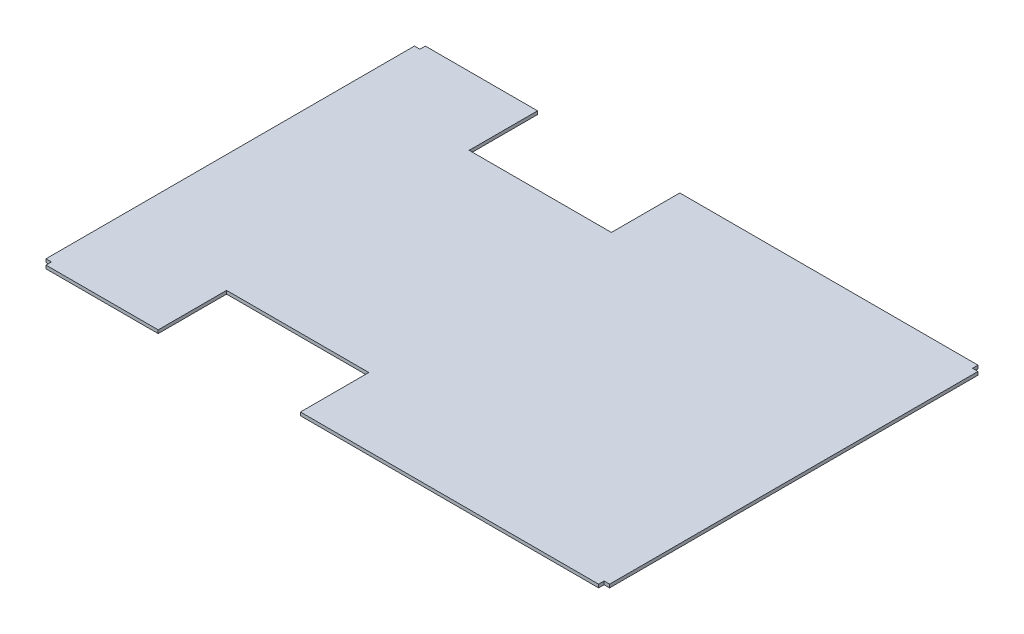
ISO-10303-21;
HEADER;
FILE_DESCRIPTION(('STEP AP214'),'2;1');
FILE_NAME('part.step','',(''),(''),'','','');
FILE_SCHEMA(('AUTOMOTIVE_DESIGN { 1 0 10303 214 1 1 1 1 }'));
ENDSEC;
DATA;
#1=APPLICATION_CONTEXT('core data for automotive mechanical design processes');
#2=APPLICATION_PROTOCOL_DEFINITION('international standard','automotive_design',2000,#1);
#3=PRODUCT_CONTEXT('',#1,'mechanical');
#4=PRODUCT('Part','Part','',(#3));
#5=PRODUCT_RELATED_PRODUCT_CATEGORY('part','',(#4));
#6=PRODUCT_DEFINITION_FORMATION('','',#4);
#7=PRODUCT_DEFINITION_CONTEXT('part definition',#1,'design');
#8=PRODUCT_DEFINITION('design','',#6,#7);
#9=PRODUCT_DEFINITION_SHAPE('','',#8);
#10=(LENGTH_UNIT() NAMED_UNIT(*) SI_UNIT(.MILLI.,.METRE.));
#11=(NAMED_UNIT(*) PLANE_ANGLE_UNIT() SI_UNIT($,.RADIAN.));
#12=(NAMED_UNIT(*) SI_UNIT($,.STERADIAN.) SOLID_ANGLE_UNIT());
#13=UNCERTAINTY_MEASURE_WITH_UNIT(LENGTH_MEASURE(1.E-05),#10,'distance_accuracy_value','');
#14=(GEOMETRIC_REPRESENTATION_CONTEXT(3) GLOBAL_UNCERTAINTY_ASSIGNED_CONTEXT((#13)) GLOBAL_UNIT_ASSIGNED_CONTEXT((#10,
#11,#12)) REPRESENTATION_CONTEXT('',''));
#15=CARTESIAN_POINT('',(0.,0.,0.));
#16=DIRECTION('',(0.,0.,1.));
#17=DIRECTION('',(1.,0.,0.));
#18=AXIS2_PLACEMENT_3D('',#15,#16,#17);
#19=CARTESIAN_POINT('',(0.,18.,0.));
#20=DIRECTION('',(0.,-1.,0.));
#21=DIRECTION('',(0.,0.,-1.));
#22=AXIS2_PLACEMENT_3D('',#19,#20,#21);
#23=PLANE('',#22);
#24=DIRECTION('',(0.,0.,-1.));
#25=VECTOR('',#24,1.);
#26=CARTESIAN_POINT('',(30.,18.,0.));
#27=LINE('',#26,#25);
#28=CARTESIAN_POINT('',(30.,18.,0.));
#29=VERTEX_POINT('',#28);
#30=CARTESIAN_POINT('',(30.,18.,-30.));
#31=VERTEX_POINT('',#30);
#32=EDGE_CURVE('E174',#29,#31,#27,.T.);
#33=ORIENTED_EDGE('',*,*,#32,.F.);
#34=DIRECTION('',(1.,0.,0.));
#35=VECTOR('',#34,1.);
#36=CARTESIAN_POINT('',(645.,18.,0.));
#37=LINE('',#36,#35);
#38=CARTESIAN_POINT('',(645.,18.,0.));
#39=VERTEX_POINT('',#38);
#40=EDGE_CURVE('E184',#29,#39,#37,.T.);
#41=ORIENTED_EDGE('',*,*,#40,.T.);
#42=DIRECTION('',(0.,0.,-1.));
#43=VECTOR('',#42,1.);
#44=CARTESIAN_POINT('',(645.,18.,-375.));
#45=LINE('',#44,#43);
#46=CARTESIAN_POINT('',(645.,18.,-375.));
#47=VERTEX_POINT('',#46);
#48=EDGE_CURVE('E191',#39,#47,#45,.T.);
#49=ORIENTED_EDGE('',*,*,#48,.T.);
#50=DIRECTION('',(1.,0.,0.));
#51=VECTOR('',#50,1.);
#52=CARTESIAN_POINT('',(1425.,18.,-375.000000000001));
#53=LINE('',#52,#51);
#54=CARTESIAN_POINT('',(1425.,18.,-375.000000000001));
#55=VERTEX_POINT('',#54);
#56=EDGE_CURVE('E194',#47,#55,#53,.T.);
#57=ORIENTED_EDGE('',*,*,#56,.T.);
#58=DIRECTION('',(0.,0.,1.));
#59=VECTOR('',#58,1.);
#60=CARTESIAN_POINT('',(1425.,18.,2.03903692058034E-13));
#61=LINE('',#60,#59);
#62=CARTESIAN_POINT('',(1425.,18.,2.03903692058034E-13));
#63=VERTEX_POINT('',#62);
#64=EDGE_CURVE('E204',#55,#63,#61,.T.);
#65=ORIENTED_EDGE('',*,*,#64,.T.);
#66=DIRECTION('',(1.,0.,0.));
#67=VECTOR('',#66,1.);
#68=CARTESIAN_POINT('',(3090.,18.,-3.63725254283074E-13));
#69=LINE('',#68,#67);
#70=CARTESIAN_POINT('',(3060.,18.,-3.53497705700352E-13));
#71=VERTEX_POINT('',#70);
#72=EDGE_CURVE('E206',#63,#71,#69,.T.);
#73=ORIENTED_EDGE('',*,*,#72,.T.);
#74=DIRECTION('',(0.,0.,1.));
#75=VECTOR('',#74,1.);
#76=CARTESIAN_POINT('',(3060.,18.,0.));
#77=LINE('',#76,#75);
#78=CARTESIAN_POINT('',(3060.,18.,-30.));
#79=VERTEX_POINT('',#78);
#80=EDGE_CURVE('E59',#79,#71,#77,.T.);
#81=ORIENTED_EDGE('',*,*,#80,.F.);
#82=DIRECTION('',(-1.,0.,0.));
#83=VECTOR('',#82,1.);
#84=CARTESIAN_POINT('',(3090.,18.,-30.));
#85=LINE('',#84,#83);
#86=CARTESIAN_POINT('',(3090.,18.,-30.));
#87=VERTEX_POINT('',#86);
#88=EDGE_CURVE('E500',#87,#79,#85,.T.);
#89=ORIENTED_EDGE('',*,*,#88,.F.);
#90=DIRECTION('',(0.,0.,-1.));
#91=VECTOR('',#90,1.);
#92=CARTESIAN_POINT('',(3090.,18.,-2080.));
#93=LINE('',#92,#91);
#94=CARTESIAN_POINT('',(3090.,18.,-2050.));
#95=VERTEX_POINT('',#94);
#96=EDGE_CURVE('E209',#87,#95,#93,.T.);
#97=ORIENTED_EDGE('',*,*,#96,.T.);
#98=DIRECTION('',(1.,0.,0.));
#99=VECTOR('',#98,1.);
#100=CARTESIAN_POINT('',(3090.,18.,-2050.));
#101=LINE('',#100,#99);
#102=CARTESIAN_POINT('',(3060.,18.,-2050.));
#103=VERTEX_POINT('',#102);
#104=EDGE_CURVE('E516',#103,#95,#101,.T.);
#105=ORIENTED_EDGE('',*,*,#104,.F.);
#106=DIRECTION('',(0.,0.,1.));
#107=VECTOR('',#106,1.);
#108=CARTESIAN_POINT('',(3060.,18.,-2080.));
#109=LINE('',#108,#107);
#110=CARTESIAN_POINT('',(3060.,18.,-2080.));
#111=VERTEX_POINT('',#110);
#112=EDGE_CURVE('E514',#111,#103,#109,.T.);
#113=ORIENTED_EDGE('',*,*,#112,.F.);
#114=DIRECTION('',(-1.,0.,0.));
#115=VECTOR('',#114,1.);
#116=CARTESIAN_POINT('',(1425.,18.,-2080.));
#117=LINE('',#116,#115);
#118=CARTESIAN_POINT('',(1425.,18.,-2080.));
#119=VERTEX_POINT('',#118);
#120=EDGE_CURVE('E211',#111,#119,#117,.T.);
#121=ORIENTED_EDGE('',*,*,#120,.T.);
#122=DIRECTION('',(0.,0.,1.));
#123=VECTOR('',#122,1.);
#124=CARTESIAN_POINT('',(1425.,18.,-1705.));
#125=LINE('',#124,#123);
#126=CARTESIAN_POINT('',(1425.,18.,-1705.));
#127=VERTEX_POINT('',#126);
#128=EDGE_CURVE('E213',#119,#127,#125,.T.);
#129=ORIENTED_EDGE('',*,*,#128,.T.);
#130=DIRECTION('',(-1.,0.,0.));
#131=VECTOR('',#130,1.);
#132=CARTESIAN_POINT('',(645.,18.,-1705.));
#133=LINE('',#132,#131);
#134=CARTESIAN_POINT('',(645.,18.,-1705.));
#135=VERTEX_POINT('',#134);
#136=EDGE_CURVE('E215',#127,#135,#133,.T.);
#137=ORIENTED_EDGE('',*,*,#136,.T.);
#138=DIRECTION('',(0.,0.,-1.));
#139=VECTOR('',#138,1.);
#140=CARTESIAN_POINT('',(645.,18.,-2080.));
#141=LINE('',#140,#139);
#142=CARTESIAN_POINT('',(645.,18.,-2080.));
#143=VERTEX_POINT('',#142);
#144=EDGE_CURVE('E217',#135,#143,#141,.T.);
#145=ORIENTED_EDGE('',*,*,#144,.T.);
#146=DIRECTION('',(-1.,0.,0.));
#147=VECTOR('',#146,1.);
#148=CARTESIAN_POINT('',(0.,18.,-2080.));
#149=LINE('',#148,#147);
#150=CARTESIAN_POINT('',(30.,18.,-2080.));
#151=VERTEX_POINT('',#150);
#152=EDGE_CURVE('E219',#143,#151,#149,.T.);
#153=ORIENTED_EDGE('',*,*,#152,.T.);
#154=DIRECTION('',(0.,0.,-1.));
#155=VECTOR('',#154,1.);
#156=CARTESIAN_POINT('',(30.,18.,-2080.));
#157=LINE('',#156,#155);
#158=CARTESIAN_POINT('',(30.,18.,-2050.));
#159=VERTEX_POINT('',#158);
#160=EDGE_CURVE('E535',#159,#151,#157,.T.);
#161=ORIENTED_EDGE('',*,*,#160,.F.);
#162=DIRECTION('',(1.,0.,0.));
#163=VECTOR('',#162,1.);
#164=CARTESIAN_POINT('',(0.,18.,-2050.));
#165=LINE('',#164,#163);
#166=CARTESIAN_POINT('',(0.,18.,-2050.));
#167=VERTEX_POINT('',#166);
#168=EDGE_CURVE('E533',#167,#159,#165,.T.);
#169=ORIENTED_EDGE('',*,*,#168,.F.);
#170=DIRECTION('',(0.,0.,1.));
#171=VECTOR('',#170,1.);
#172=CARTESIAN_POINT('',(0.,18.,0.));
#173=LINE('',#172,#171);
#174=CARTESIAN_POINT('',(0.,18.,-30.));
#175=VERTEX_POINT('',#174);
#176=EDGE_CURVE('E222',#167,#175,#173,.T.);
#177=ORIENTED_EDGE('',*,*,#176,.T.);
#178=DIRECTION('',(-1.,0.,0.));
#179=VECTOR('',#178,1.);
#180=CARTESIAN_POINT('',(0.,18.,-30.));
#181=LINE('',#180,#179);
#182=EDGE_CURVE('E187',#31,#175,#181,.T.);
#183=ORIENTED_EDGE('',*,*,#182,.F.);
#184=EDGE_LOOP('',(#33,#41,#49,#57,#65,#73,#81,#89,#97,#105,#113,#121,#129,#137,#145,#153,#161,
#169,#177,#183));
#185=FACE_BOUND('',#184,.T.);
#186=ADVANCED_FACE('F36',(#185),#23,.F.);
#187=CARTESIAN_POINT('',(0.,0.,0.));
#188=DIRECTION('',(0.,-1.,0.));
#189=DIRECTION('',(0.,0.,-1.));
#190=AXIS2_PLACEMENT_3D('',#187,#188,#189);
#191=PLANE('',#190);
#192=DIRECTION('',(1.,0.,0.));
#193=VECTOR('',#192,1.);
#194=CARTESIAN_POINT('',(645.,0.,0.));
#195=LINE('',#194,#193);
#196=CARTESIAN_POINT('',(29.9999999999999,0.,0.));
#197=VERTEX_POINT('',#196);
#198=CARTESIAN_POINT('',(645.,0.,0.));
#199=VERTEX_POINT('',#198);
#200=EDGE_CURVE('E225',#197,#199,#195,.T.);
#201=ORIENTED_EDGE('',*,*,#200,.F.);
#202=DIRECTION('',(0.,0.,-1.));
#203=VECTOR('',#202,1.);
#204=CARTESIAN_POINT('',(30.,0.,0.));
#205=LINE('',#204,#203);
#206=CARTESIAN_POINT('',(30.,0.,-30.));
#207=VERTEX_POINT('',#206);
#208=EDGE_CURVE('E51',#197,#207,#205,.T.);
#209=ORIENTED_EDGE('',*,*,#208,.T.);
#210=DIRECTION('',(-1.,0.,0.));
#211=VECTOR('',#210,1.);
#212=CARTESIAN_POINT('',(0.,0.,-30.));
#213=LINE('',#212,#211);
#214=CARTESIAN_POINT('',(0.,0.,-30.));
#215=VERTEX_POINT('',#214);
#216=EDGE_CURVE('E188',#207,#215,#213,.T.);
#217=ORIENTED_EDGE('',*,*,#216,.T.);
#218=DIRECTION('',(0.,0.,1.));
#219=VECTOR('',#218,1.);
#220=CARTESIAN_POINT('',(0.,0.,0.));
#221=LINE('',#220,#219);
#222=CARTESIAN_POINT('',(0.,0.,-2050.));
#223=VERTEX_POINT('',#222);
#224=EDGE_CURVE('E192',#223,#215,#221,.T.);
#225=ORIENTED_EDGE('',*,*,#224,.F.);
#226=DIRECTION('',(1.,0.,0.));
#227=VECTOR('',#226,1.);
#228=CARTESIAN_POINT('',(0.,0.,-2050.));
#229=LINE('',#228,#227);
#230=CARTESIAN_POINT('',(30.,0.,-2050.));
#231=VERTEX_POINT('',#230);
#232=EDGE_CURVE('E532',#223,#231,#229,.T.);
#233=ORIENTED_EDGE('',*,*,#232,.T.);
#234=DIRECTION('',(0.,0.,-1.));
#235=VECTOR('',#234,1.);
#236=CARTESIAN_POINT('',(30.,0.,-2080.));
#237=LINE('',#236,#235);
#238=CARTESIAN_POINT('',(30.,0.,-2080.));
#239=VERTEX_POINT('',#238);
#240=EDGE_CURVE('E536',#231,#239,#237,.T.);
#241=ORIENTED_EDGE('',*,*,#240,.T.);
#242=DIRECTION('',(-1.,0.,0.));
#243=VECTOR('',#242,1.);
#244=CARTESIAN_POINT('',(0.,0.,-2080.));
#245=LINE('',#244,#243);
#246=CARTESIAN_POINT('',(645.,0.,-2080.));
#247=VERTEX_POINT('',#246);
#248=EDGE_CURVE('E197',#247,#239,#245,.T.);
#249=ORIENTED_EDGE('',*,*,#248,.F.);
#250=DIRECTION('',(0.,0.,-1.));
#251=VECTOR('',#250,1.);
#252=CARTESIAN_POINT('',(645.,0.,-2080.));
#253=LINE('',#252,#251);
#254=CARTESIAN_POINT('',(645.,0.,-1705.));
#255=VERTEX_POINT('',#254);
#256=EDGE_CURVE('E244',#255,#247,#253,.T.);
#257=ORIENTED_EDGE('',*,*,#256,.F.);
#258=DIRECTION('',(-1.,0.,0.));
#259=VECTOR('',#258,1.);
#260=CARTESIAN_POINT('',(645.,0.,-1705.));
#261=LINE('',#260,#259);
#262=CARTESIAN_POINT('',(1425.,0.,-1705.));
#263=VERTEX_POINT('',#262);
#264=EDGE_CURVE('E242',#263,#255,#261,.T.);
#265=ORIENTED_EDGE('',*,*,#264,.F.);
#266=DIRECTION('',(0.,0.,1.));
#267=VECTOR('',#266,1.);
#268=CARTESIAN_POINT('',(1425.,0.,-1705.));
#269=LINE('',#268,#267);
#270=CARTESIAN_POINT('',(1425.,0.,-2080.));
#271=VERTEX_POINT('',#270);
#272=EDGE_CURVE('E240',#271,#263,#269,.T.);
#273=ORIENTED_EDGE('',*,*,#272,.F.);
#274=DIRECTION('',(-1.,0.,0.));
#275=VECTOR('',#274,1.);
#276=CARTESIAN_POINT('',(1425.,0.,-2080.));
#277=LINE('',#276,#275);
#278=CARTESIAN_POINT('',(3060.,0.,-2080.));
#279=VERTEX_POINT('',#278);
#280=EDGE_CURVE('E238',#279,#271,#277,.T.);
#281=ORIENTED_EDGE('',*,*,#280,.F.);
#282=DIRECTION('',(0.,0.,1.));
#283=VECTOR('',#282,1.);
#284=CARTESIAN_POINT('',(3060.,0.,-2080.));
#285=LINE('',#284,#283);
#286=CARTESIAN_POINT('',(3060.,0.,-2050.));
#287=VERTEX_POINT('',#286);
#288=EDGE_CURVE('E513',#279,#287,#285,.T.);
#289=ORIENTED_EDGE('',*,*,#288,.T.);
#290=DIRECTION('',(1.,0.,0.));
#291=VECTOR('',#290,1.);
#292=CARTESIAN_POINT('',(3090.,0.,-2050.));
#293=LINE('',#292,#291);
#294=CARTESIAN_POINT('',(3090.,0.,-2050.));
#295=VERTEX_POINT('',#294);
#296=EDGE_CURVE('E517',#287,#295,#293,.T.);
#297=ORIENTED_EDGE('',*,*,#296,.T.);
#298=DIRECTION('',(0.,0.,-1.));
#299=VECTOR('',#298,1.);
#300=CARTESIAN_POINT('',(3090.,0.,-2080.));
#301=LINE('',#300,#299);
#302=CARTESIAN_POINT('',(3090.,0.,-30.));
#303=VERTEX_POINT('',#302);
#304=EDGE_CURVE('E236',#303,#295,#301,.T.);
#305=ORIENTED_EDGE('',*,*,#304,.F.);
#306=DIRECTION('',(-1.,0.,0.));
#307=VECTOR('',#306,1.);
#308=CARTESIAN_POINT('',(3090.,0.,-30.));
#309=LINE('',#308,#307);
#310=CARTESIAN_POINT('',(3060.,0.,-30.));
#311=VERTEX_POINT('',#310);
#312=EDGE_CURVE('E179',#303,#311,#309,.T.);
#313=ORIENTED_EDGE('',*,*,#312,.T.);
#314=DIRECTION('',(0.,0.,1.));
#315=VECTOR('',#314,1.);
#316=CARTESIAN_POINT('',(3060.,0.,0.));
#317=LINE('',#316,#315);
#318=CARTESIAN_POINT('',(3060.,0.,0.));
#319=VERTEX_POINT('',#318);
#320=EDGE_CURVE('E502',#311,#319,#317,.T.);
#321=ORIENTED_EDGE('',*,*,#320,.T.);
#322=DIRECTION('',(1.,0.,0.));
#323=VECTOR('',#322,1.);
#324=CARTESIAN_POINT('',(3090.,0.,-3.63725254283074E-13));
#325=LINE('',#324,#323);
#326=CARTESIAN_POINT('',(1425.,0.,2.03903692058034E-13));
#327=VERTEX_POINT('',#326);
#328=EDGE_CURVE('E233',#327,#319,#325,.T.);
#329=ORIENTED_EDGE('',*,*,#328,.F.);
#330=DIRECTION('',(0.,0.,1.));
#331=VECTOR('',#330,1.);
#332=CARTESIAN_POINT('',(1425.,0.,2.03903692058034E-13));
#333=LINE('',#332,#331);
#334=CARTESIAN_POINT('',(1425.,0.,-375.000000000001));
#335=VERTEX_POINT('',#334);
#336=EDGE_CURVE('E231',#335,#327,#333,.T.);
#337=ORIENTED_EDGE('',*,*,#336,.F.);
#338=DIRECTION('',(1.,0.,0.));
#339=VECTOR('',#338,1.);
#340=CARTESIAN_POINT('',(1425.,0.,-375.000000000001));
#341=LINE('',#340,#339);
#342=CARTESIAN_POINT('',(645.,0.,-375.));
#343=VERTEX_POINT('',#342);
#344=EDGE_CURVE('E229',#343,#335,#341,.T.);
#345=ORIENTED_EDGE('',*,*,#344,.F.);
#346=DIRECTION('',(0.,0.,-1.));
#347=VECTOR('',#346,1.);
#348=CARTESIAN_POINT('',(645.,0.,-375.));
#349=LINE('',#348,#347);
#350=EDGE_CURVE('E227',#199,#343,#349,.T.);
#351=ORIENTED_EDGE('',*,*,#350,.F.);
#352=EDGE_LOOP('',(#201,#209,#217,#225,#233,#241,#249,#257,#265,#273,#281,#289,#297,#305,#313,
#321,#329,#337,#345,#351));
#353=FACE_BOUND('',#352,.T.);
#354=ADVANCED_FACE('F275',(#353),#191,.T.);
#355=CARTESIAN_POINT('',(0.,18.,0.));
#356=DIRECTION('',(1.,0.,0.));
#357=DIRECTION('',(0.,0.,-1.));
#358=AXIS2_PLACEMENT_3D('',#355,#356,#357);
#359=PLANE('',#358);
#360=DIRECTION('',(0.,-1.,0.));
#361=VECTOR('',#360,1.);
#362=CARTESIAN_POINT('',(0.,18.,-30.));
#363=LINE('',#362,#361);
#364=EDGE_CURVE('E492',#175,#215,#363,.T.);
#365=ORIENTED_EDGE('',*,*,#364,.F.);
#366=ORIENTED_EDGE('',*,*,#176,.F.);
#367=DIRECTION('',(0.,-1.,0.));
#368=VECTOR('',#367,1.);
#369=CARTESIAN_POINT('',(0.,18.,-2050.));
#370=LINE('',#369,#368);
#371=EDGE_CURVE('E200',#167,#223,#370,.T.);
#372=ORIENTED_EDGE('',*,*,#371,.T.);
#373=ORIENTED_EDGE('',*,*,#224,.T.);
#374=EDGE_LOOP('',(#365,#366,#372,#373));
#375=FACE_BOUND('',#374,.T.);
#376=ADVANCED_FACE('F303',(#375),#359,.F.);
#377=CARTESIAN_POINT('',(645.,18.,0.));
#378=DIRECTION('',(0.,0.,-1.));
#379=DIRECTION('',(-1.,0.,0.));
#380=AXIS2_PLACEMENT_3D('',#377,#378,#379);
#381=PLANE('',#380);
#382=DIRECTION('',(0.,-1.,0.));
#383=VECTOR('',#382,1.);
#384=CARTESIAN_POINT('',(30.,18.,0.));
#385=LINE('',#384,#383);
#386=EDGE_CURVE('E171',#29,#197,#385,.T.);
#387=ORIENTED_EDGE('',*,*,#386,.T.);
#388=ORIENTED_EDGE('',*,*,#200,.T.);
#389=DIRECTION('',(0.,-1.,0.));
#390=VECTOR('',#389,1.);
#391=CARTESIAN_POINT('',(645.,18.,0.));
#392=LINE('',#391,#390);
#393=EDGE_CURVE('E11',#39,#199,#392,.T.);
#394=ORIENTED_EDGE('',*,*,#393,.F.);
#395=ORIENTED_EDGE('',*,*,#40,.F.);
#396=EDGE_LOOP('',(#387,#388,#394,#395));
#397=FACE_BOUND('',#396,.T.);
#398=ADVANCED_FACE('F38',(#397),#381,.F.);
#399=CARTESIAN_POINT('',(3090.,18.,-2080.));
#400=DIRECTION('',(-1.,0.,0.));
#401=DIRECTION('',(0.,0.,1.));
#402=AXIS2_PLACEMENT_3D('',#399,#400,#401);
#403=PLANE('',#402);
#404=DIRECTION('',(0.,-1.,0.));
#405=VECTOR('',#404,1.);
#406=CARTESIAN_POINT('',(3090.,18.,-30.));
#407=LINE('',#406,#405);
#408=EDGE_CURVE('E510',#87,#303,#407,.T.);
#409=ORIENTED_EDGE('',*,*,#408,.T.);
#410=ORIENTED_EDGE('',*,*,#304,.T.);
#411=DIRECTION('',(0.,-1.,0.));
#412=VECTOR('',#411,1.);
#413=CARTESIAN_POINT('',(3090.,18.,-2050.));
#414=LINE('',#413,#412);
#415=EDGE_CURVE('E520',#95,#295,#414,.T.);
#416=ORIENTED_EDGE('',*,*,#415,.F.);
#417=ORIENTED_EDGE('',*,*,#96,.F.);
#418=EDGE_LOOP('',(#409,#410,#416,#417));
#419=FACE_BOUND('',#418,.T.);
#420=ADVANCED_FACE('F327',(#419),#403,.F.);
#421=CARTESIAN_POINT('',(3090.,18.,-3.63725254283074E-13));
#422=DIRECTION('',(0.,0.,-1.));
#423=DIRECTION('',(-1.,0.,0.));
#424=AXIS2_PLACEMENT_3D('',#421,#422,#423);
#425=PLANE('',#424);
#426=DIRECTION('',(0.,-1.,0.));
#427=VECTOR('',#426,1.);
#428=CARTESIAN_POINT('',(3060.,18.,0.));
#429=LINE('',#428,#427);
#430=EDGE_CURVE('E285',#71,#319,#429,.T.);
#431=ORIENTED_EDGE('',*,*,#430,.F.);
#432=ORIENTED_EDGE('',*,*,#72,.F.);
#433=DIRECTION('',(0.,-1.,0.));
#434=VECTOR('',#433,1.);
#435=CARTESIAN_POINT('',(1425.,18.,2.03903692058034E-13));
#436=LINE('',#435,#434);
#437=EDGE_CURVE('E259',#63,#327,#436,.T.);
#438=ORIENTED_EDGE('',*,*,#437,.T.);
#439=ORIENTED_EDGE('',*,*,#328,.T.);
#440=EDGE_LOOP('',(#431,#432,#438,#439));
#441=FACE_BOUND('',#440,.T.);
#442=ADVANCED_FACE('F284',(#441),#425,.F.);
#443=CARTESIAN_POINT('',(1425.,18.,-2080.));
#444=DIRECTION('',(0.,0.,1.));
#445=DIRECTION('',(1.,0.,0.));
#446=AXIS2_PLACEMENT_3D('',#443,#444,#445);
#447=PLANE('',#446);
#448=DIRECTION('',(0.,-1.,0.));
#449=VECTOR('',#448,1.);
#450=CARTESIAN_POINT('',(3060.,18.,-2080.));
#451=LINE('',#450,#449);
#452=EDGE_CURVE('E529',#111,#279,#451,.T.);
#453=ORIENTED_EDGE('',*,*,#452,.T.);
#454=ORIENTED_EDGE('',*,*,#280,.T.);
#455=DIRECTION('',(0.,-1.,0.));
#456=VECTOR('',#455,1.);
#457=CARTESIAN_POINT('',(1425.,18.,-2080.));
#458=LINE('',#457,#456);
#459=EDGE_CURVE('E256',#119,#271,#458,.T.);
#460=ORIENTED_EDGE('',*,*,#459,.F.);
#461=ORIENTED_EDGE('',*,*,#120,.F.);
#462=EDGE_LOOP('',(#453,#454,#460,#461));
#463=FACE_BOUND('',#462,.T.);
#464=ADVANCED_FACE('F295',(#463),#447,.F.);
#465=CARTESIAN_POINT('',(0.,18.,-2080.));
#466=DIRECTION('',(0.,0.,1.));
#467=DIRECTION('',(1.,0.,0.));
#468=AXIS2_PLACEMENT_3D('',#465,#466,#467);
#469=PLANE('',#468);
#470=DIRECTION('',(0.,-1.,0.));
#471=VECTOR('',#470,1.);
#472=CARTESIAN_POINT('',(30.,18.,-2080.));
#473=LINE('',#472,#471);
#474=EDGE_CURVE('E538',#151,#239,#473,.T.);
#475=ORIENTED_EDGE('',*,*,#474,.F.);
#476=ORIENTED_EDGE('',*,*,#152,.F.);
#477=DIRECTION('',(0.,-1.,0.));
#478=VECTOR('',#477,1.);
#479=CARTESIAN_POINT('',(645.,18.,-2080.));
#480=LINE('',#479,#478);
#481=EDGE_CURVE('E224',#143,#247,#480,.T.);
#482=ORIENTED_EDGE('',*,*,#481,.T.);
#483=ORIENTED_EDGE('',*,*,#248,.T.);
#484=EDGE_LOOP('',(#475,#476,#482,#483));
#485=FACE_BOUND('',#484,.T.);
#486=ADVANCED_FACE('F289',(#485),#469,.F.);
#487=CARTESIAN_POINT('',(645.,18.,-375.));
#488=DIRECTION('',(-1.,0.,0.));
#489=DIRECTION('',(0.,0.,1.));
#490=AXIS2_PLACEMENT_3D('',#487,#488,#489);
#491=PLANE('',#490);
#492=ORIENTED_EDGE('',*,*,#350,.T.);
#493=DIRECTION('',(0.,-1.,0.));
#494=VECTOR('',#493,1.);
#495=CARTESIAN_POINT('',(645.,18.,-375.));
#496=LINE('',#495,#494);
#497=EDGE_CURVE('E44',#47,#343,#496,.T.);
#498=ORIENTED_EDGE('',*,*,#497,.F.);
#499=ORIENTED_EDGE('',*,*,#48,.F.);
#500=ORIENTED_EDGE('',*,*,#393,.T.);
#501=EDGE_LOOP('',(#492,#498,#499,#500));
#502=FACE_BOUND('',#501,.T.);
#503=ADVANCED_FACE('F287',(#502),#491,.F.);
#504=CARTESIAN_POINT('',(1425.,18.,-375.000000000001));
#505=DIRECTION('',(0.,0.,-1.));
#506=DIRECTION('',(-1.,0.,0.));
#507=AXIS2_PLACEMENT_3D('',#504,#505,#506);
#508=PLANE('',#507);
#509=ORIENTED_EDGE('',*,*,#344,.T.);
#510=DIRECTION('',(0.,-1.,0.));
#511=VECTOR('',#510,1.);
#512=CARTESIAN_POINT('',(1425.,18.,-375.000000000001));
#513=LINE('',#512,#511);
#514=EDGE_CURVE('E262',#55,#335,#513,.T.);
#515=ORIENTED_EDGE('',*,*,#514,.F.);
#516=ORIENTED_EDGE('',*,*,#56,.F.);
#517=ORIENTED_EDGE('',*,*,#497,.T.);
#518=EDGE_LOOP('',(#509,#515,#516,#517));
#519=FACE_BOUND('',#518,.T.);
#520=ADVANCED_FACE('F269',(#519),#508,.F.);
#521=CARTESIAN_POINT('',(1425.,18.,2.03903692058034E-13));
#522=DIRECTION('',(1.,0.,0.));
#523=DIRECTION('',(0.,0.,-1.));
#524=AXIS2_PLACEMENT_3D('',#521,#522,#523);
#525=PLANE('',#524);
#526=ORIENTED_EDGE('',*,*,#336,.T.);
#527=ORIENTED_EDGE('',*,*,#437,.F.);
#528=ORIENTED_EDGE('',*,*,#64,.F.);
#529=ORIENTED_EDGE('',*,*,#514,.T.);
#530=EDGE_LOOP('',(#526,#527,#528,#529));
#531=FACE_BOUND('',#530,.T.);
#532=ADVANCED_FACE('F280',(#531),#525,.F.);
#533=CARTESIAN_POINT('',(1425.,18.,-1705.));
#534=DIRECTION('',(1.,0.,0.));
#535=DIRECTION('',(0.,0.,-1.));
#536=AXIS2_PLACEMENT_3D('',#533,#534,#535);
#537=PLANE('',#536);
#538=ORIENTED_EDGE('',*,*,#272,.T.);
#539=DIRECTION('',(0.,-1.,0.));
#540=VECTOR('',#539,1.);
#541=CARTESIAN_POINT('',(1425.,18.,-1705.));
#542=LINE('',#541,#540);
#543=EDGE_CURVE('E253',#127,#263,#542,.T.);
#544=ORIENTED_EDGE('',*,*,#543,.F.);
#545=ORIENTED_EDGE('',*,*,#128,.F.);
#546=ORIENTED_EDGE('',*,*,#459,.T.);
#547=EDGE_LOOP('',(#538,#544,#545,#546));
#548=FACE_BOUND('',#547,.T.);
#549=ADVANCED_FACE('F319',(#548),#537,.F.);
#550=CARTESIAN_POINT('',(645.,18.,-1705.));
#551=DIRECTION('',(0.,0.,1.));
#552=DIRECTION('',(1.,0.,0.));
#553=AXIS2_PLACEMENT_3D('',#550,#551,#552);
#554=PLANE('',#553);
#555=ORIENTED_EDGE('',*,*,#264,.T.);
#556=DIRECTION('',(0.,-1.,0.));
#557=VECTOR('',#556,1.);
#558=CARTESIAN_POINT('',(645.,18.,-1705.));
#559=LINE('',#558,#557);
#560=EDGE_CURVE('E250',#135,#255,#559,.T.);
#561=ORIENTED_EDGE('',*,*,#560,.F.);
#562=ORIENTED_EDGE('',*,*,#136,.F.);
#563=ORIENTED_EDGE('',*,*,#543,.T.);
#564=EDGE_LOOP('',(#555,#561,#562,#563));
#565=FACE_BOUND('',#564,.T.);
#566=ADVANCED_FACE('F315',(#565),#554,.F.);
#567=CARTESIAN_POINT('',(645.,18.,-2080.));
#568=DIRECTION('',(-1.,0.,0.));
#569=DIRECTION('',(0.,0.,1.));
#570=AXIS2_PLACEMENT_3D('',#567,#568,#569);
#571=PLANE('',#570);
#572=ORIENTED_EDGE('',*,*,#256,.T.);
#573=ORIENTED_EDGE('',*,*,#481,.F.);
#574=ORIENTED_EDGE('',*,*,#144,.F.);
#575=ORIENTED_EDGE('',*,*,#560,.T.);
#576=EDGE_LOOP('',(#572,#573,#574,#575));
#577=FACE_BOUND('',#576,.T.);
#578=ADVANCED_FACE('F312',(#577),#571,.F.);
#579=CARTESIAN_POINT('',(0.,18.,-2050.));
#580=DIRECTION('',(0.,0.,-1.));
#581=DIRECTION('',(-1.,0.,0.));
#582=AXIS2_PLACEMENT_3D('',#579,#580,#581);
#583=PLANE('',#582);
#584=ORIENTED_EDGE('',*,*,#232,.F.);
#585=ORIENTED_EDGE('',*,*,#371,.F.);
#586=ORIENTED_EDGE('',*,*,#168,.T.);
#587=DIRECTION('',(0.,-1.,0.));
#588=VECTOR('',#587,1.);
#589=CARTESIAN_POINT('',(30.,18.,-2050.));
#590=LINE('',#589,#588);
#591=EDGE_CURVE('E543',#159,#231,#590,.T.);
#592=ORIENTED_EDGE('',*,*,#591,.T.);
#593=EDGE_LOOP('',(#584,#585,#586,#592));
#594=FACE_BOUND('',#593,.T.);
#595=ADVANCED_FACE('F306',(#594),#583,.T.);
#596=CARTESIAN_POINT('',(30.,18.,-2080.));
#597=DIRECTION('',(-1.,0.,0.));
#598=DIRECTION('',(0.,0.,1.));
#599=AXIS2_PLACEMENT_3D('',#596,#597,#598);
#600=PLANE('',#599);
#601=ORIENTED_EDGE('',*,*,#240,.F.);
#602=ORIENTED_EDGE('',*,*,#591,.F.);
#603=ORIENTED_EDGE('',*,*,#160,.T.);
#604=ORIENTED_EDGE('',*,*,#474,.T.);
#605=EDGE_LOOP('',(#601,#602,#603,#604));
#606=FACE_BOUND('',#605,.T.);
#607=ADVANCED_FACE('F356',(#606),#600,.T.);
#608=CARTESIAN_POINT('',(3060.,18.,-2080.));
#609=DIRECTION('',(1.,0.,0.));
#610=DIRECTION('',(0.,0.,-1.));
#611=AXIS2_PLACEMENT_3D('',#608,#609,#610);
#612=PLANE('',#611);
#613=ORIENTED_EDGE('',*,*,#288,.F.);
#614=ORIENTED_EDGE('',*,*,#452,.F.);
#615=ORIENTED_EDGE('',*,*,#112,.T.);
#616=DIRECTION('',(0.,-1.,0.));
#617=VECTOR('',#616,1.);
#618=CARTESIAN_POINT('',(3060.,18.,-2050.));
#619=LINE('',#618,#617);
#620=EDGE_CURVE('E527',#103,#287,#619,.T.);
#621=ORIENTED_EDGE('',*,*,#620,.T.);
#622=EDGE_LOOP('',(#613,#614,#615,#621));
#623=FACE_BOUND('',#622,.T.);
#624=ADVANCED_FACE('F364',(#623),#612,.T.);
#625=CARTESIAN_POINT('',(3090.,18.,-2050.));
#626=DIRECTION('',(0.,0.,-1.));
#627=DIRECTION('',(-1.,0.,0.));
#628=AXIS2_PLACEMENT_3D('',#625,#626,#627);
#629=PLANE('',#628);
#630=ORIENTED_EDGE('',*,*,#296,.F.);
#631=ORIENTED_EDGE('',*,*,#620,.F.);
#632=ORIENTED_EDGE('',*,*,#104,.T.);
#633=ORIENTED_EDGE('',*,*,#415,.T.);
#634=EDGE_LOOP('',(#630,#631,#632,#633));
#635=FACE_BOUND('',#634,.T.);
#636=ADVANCED_FACE('F371',(#635),#629,.T.);
#637=CARTESIAN_POINT('',(3090.,18.,-30.));
#638=DIRECTION('',(0.,0.,1.));
#639=DIRECTION('',(1.,0.,0.));
#640=AXIS2_PLACEMENT_3D('',#637,#638,#639);
#641=PLANE('',#640);
#642=ORIENTED_EDGE('',*,*,#312,.F.);
#643=ORIENTED_EDGE('',*,*,#408,.F.);
#644=ORIENTED_EDGE('',*,*,#88,.T.);
#645=DIRECTION('',(0.,-1.,0.));
#646=VECTOR('',#645,1.);
#647=CARTESIAN_POINT('',(3060.,18.,-30.));
#648=LINE('',#647,#646);
#649=EDGE_CURVE('E508',#79,#311,#648,.T.);
#650=ORIENTED_EDGE('',*,*,#649,.T.);
#651=EDGE_LOOP('',(#642,#643,#644,#650));
#652=FACE_BOUND('',#651,.T.);
#653=ADVANCED_FACE('F379',(#652),#641,.T.);
#654=CARTESIAN_POINT('',(3060.,18.,0.));
#655=DIRECTION('',(1.,0.,0.));
#656=DIRECTION('',(0.,0.,-1.));
#657=AXIS2_PLACEMENT_3D('',#654,#655,#656);
#658=PLANE('',#657);
#659=ORIENTED_EDGE('',*,*,#320,.F.);
#660=ORIENTED_EDGE('',*,*,#649,.F.);
#661=ORIENTED_EDGE('',*,*,#80,.T.);
#662=ORIENTED_EDGE('',*,*,#430,.T.);
#663=EDGE_LOOP('',(#659,#660,#661,#662));
#664=FACE_BOUND('',#663,.T.);
#665=ADVANCED_FACE('F387',(#664),#658,.T.);
#666=CARTESIAN_POINT('',(30.,18.,0.));
#667=DIRECTION('',(-1.,0.,0.));
#668=DIRECTION('',(0.,0.,1.));
#669=AXIS2_PLACEMENT_3D('',#666,#667,#668);
#670=PLANE('',#669);
#671=ORIENTED_EDGE('',*,*,#208,.F.);
#672=ORIENTED_EDGE('',*,*,#386,.F.);
#673=ORIENTED_EDGE('',*,*,#32,.T.);
#674=DIRECTION('',(0.,-1.,0.));
#675=VECTOR('',#674,1.);
#676=CARTESIAN_POINT('',(30.,18.,-30.));
#677=LINE('',#676,#675);
#678=EDGE_CURVE('E180',#31,#207,#677,.T.);
#679=ORIENTED_EDGE('',*,*,#678,.T.);
#680=EDGE_LOOP('',(#671,#672,#673,#679));
#681=FACE_BOUND('',#680,.T.);
#682=ADVANCED_FACE('F173',(#681),#670,.T.);
#683=CARTESIAN_POINT('',(0.,18.,-30.));
#684=DIRECTION('',(0.,0.,1.));
#685=DIRECTION('',(1.,0.,0.));
#686=AXIS2_PLACEMENT_3D('',#683,#684,#685);
#687=PLANE('',#686);
#688=ORIENTED_EDGE('',*,*,#216,.F.);
#689=ORIENTED_EDGE('',*,*,#678,.F.);
#690=ORIENTED_EDGE('',*,*,#182,.T.);
#691=ORIENTED_EDGE('',*,*,#364,.T.);
#692=EDGE_LOOP('',(#688,#689,#690,#691));
#693=FACE_BOUND('',#692,.T.);
#694=ADVANCED_FACE('F401',(#693),#687,.T.);
#695=CLOSED_SHELL('',(#186,#354,#376,#398,#420,#442,#464,#486,#503,#520,#532,#549,#566,#578,
#595,#607,#624,#636,#653,#665,#682,#694));
#696=MANIFOLD_SOLID_BREP('B2',#695);
#697=ADVANCED_BREP_SHAPE_REPRESENTATION('',(#18,#696),#14);
#698=SHAPE_DEFINITION_REPRESENTATION(#9,#697);
ENDSEC;
END-ISO-10303-21;
